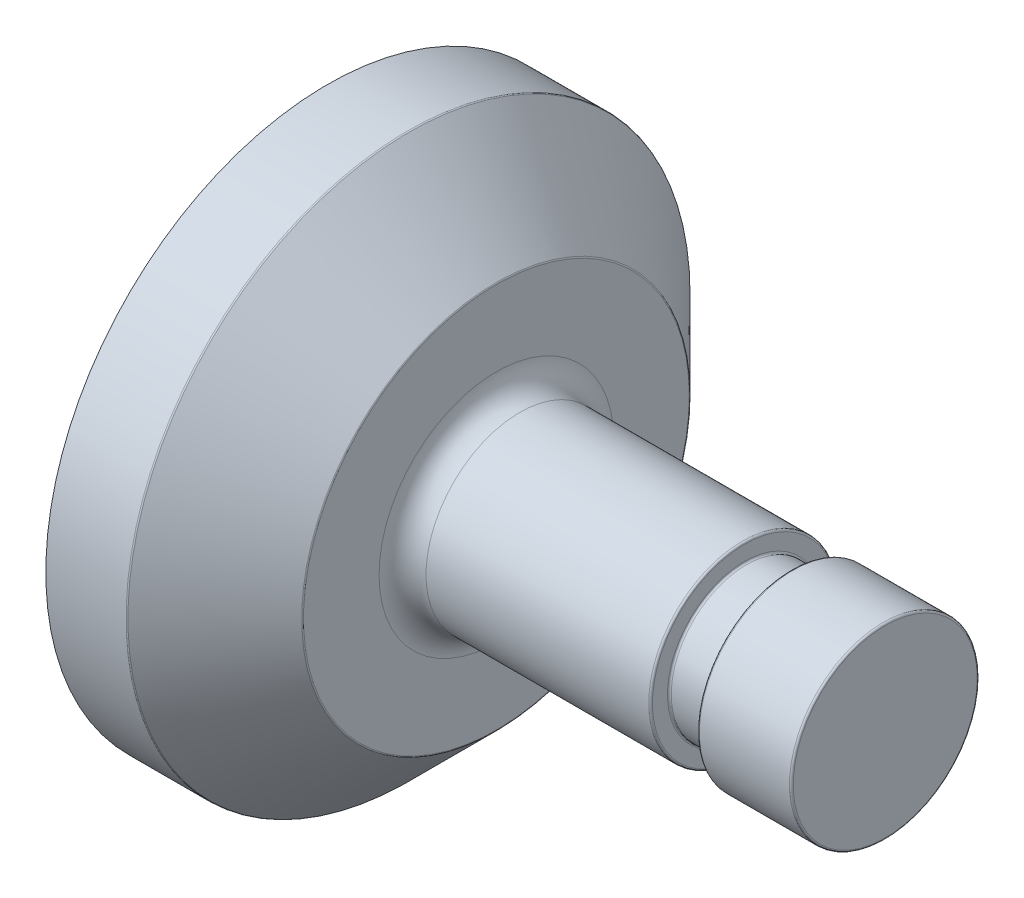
from build123d import *


with BuildPart() as part:
    # Sketch1 → Revolve2 (revolve)
    with BuildSketch(Plane.XY, mode=Mode.PRIVATE) as revolve2_sk:
        with BuildLine():
            Line((0, 0), (0, 12.446))
            ThreePointArc((0, 12.446), (-0.074394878, 12.625605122), (-0.254, 12.7))
            Line((-0.254, 12.7), (-12.446, 12.7))
            ThreePointArc((-12.446, 12.7), (-12.625605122, 12.625605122), (-12.7, 12.446))
            Line((-12.7, 12.446), (-12.7, 10.414))
            ThreePointArc((-12.7, 10.414), (-12.774394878, 10.234394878), (-12.954, 10.16))
            Line((-12.954, 10.16), (-18.796, 10.16))
            ThreePointArc((-18.796, 10.16), (-18.975605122, 10.234394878), (-19.05, 10.414))
            Line((-19.05, 10.414), (-19.05, 12.446))
            ThreePointArc((-19.05, 12.446), (-19.124394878, 12.625605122), (-19.304, 12.7))
            Line((-19.304, 12.7), (-49.432786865, 12.7))
            ThreePointArc((-49.432786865, 12.7), (-51.677850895, 13.62993597), (-52.607786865, 15.875))
            Line((-52.607786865, 15.875), (-52.607786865, 26.095799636))
            ThreePointArc((-52.607786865, 26.095799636), (-52.627121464, 26.193001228), (-52.682181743, 26.275404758))
            Line((-52.682181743, 26.275404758), (-64.432382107, 38.025605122))
            ThreePointArc((-64.432382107, 38.025605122), (-64.514785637, 38.080665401), (-64.611987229, 38.1))
            Line((-64.611987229, 38.1), (-75.470714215, 38.1))
            Line((-75.470714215, 38.1), (-75.470714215, 0))
            Line((-75.470714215, 0), (0, 0))
        make_face()
    revolve(revolve2_sk.sketch.rotate(Axis((4.582425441, 0, 0), (-1, 0, 0)), 90), axis=Axis((4.582425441, 0, 0), (-1, 0, 0)))


solid = part.part
